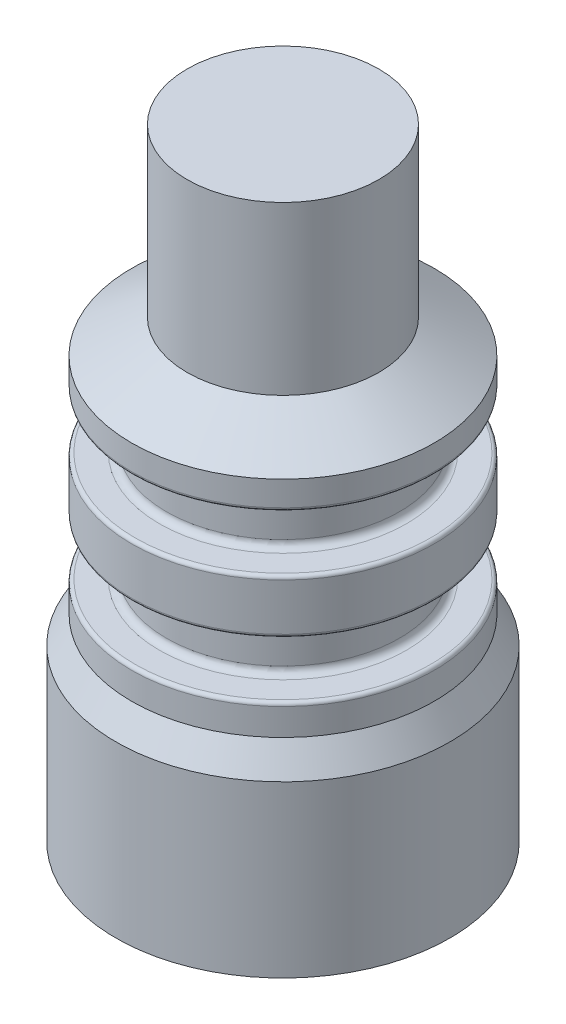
ISO-10303-21;
HEADER;
FILE_DESCRIPTION(('STEP AP214'),'2;1');
FILE_NAME('part.step','',(''),(''),'','','');
FILE_SCHEMA(('AUTOMOTIVE_DESIGN { 1 0 10303 214 1 1 1 1 }'));
ENDSEC;
DATA;
#1=APPLICATION_CONTEXT('core data for automotive mechanical design processes');
#2=APPLICATION_PROTOCOL_DEFINITION('international standard','automotive_design',2000,#1);
#3=PRODUCT_CONTEXT('',#1,'mechanical');
#4=PRODUCT('Part','Part','',(#3));
#5=PRODUCT_RELATED_PRODUCT_CATEGORY('part','',(#4));
#6=PRODUCT_DEFINITION_FORMATION('','',#4);
#7=PRODUCT_DEFINITION_CONTEXT('part definition',#1,'design');
#8=PRODUCT_DEFINITION('design','',#6,#7);
#9=PRODUCT_DEFINITION_SHAPE('','',#8);
#10=(LENGTH_UNIT() NAMED_UNIT(*) SI_UNIT(.MILLI.,.METRE.));
#11=(NAMED_UNIT(*) PLANE_ANGLE_UNIT() SI_UNIT($,.RADIAN.));
#12=(NAMED_UNIT(*) SI_UNIT($,.STERADIAN.) SOLID_ANGLE_UNIT());
#13=UNCERTAINTY_MEASURE_WITH_UNIT(LENGTH_MEASURE(1.E-05),#10,'distance_accuracy_value','');
#14=(GEOMETRIC_REPRESENTATION_CONTEXT(3) GLOBAL_UNCERTAINTY_ASSIGNED_CONTEXT((#13)) GLOBAL_UNIT_ASSIGNED_CONTEXT((#10,
#11,#12)) REPRESENTATION_CONTEXT('',''));
#15=CARTESIAN_POINT('',(0.,0.,0.));
#16=DIRECTION('',(0.,0.,1.));
#17=DIRECTION('',(1.,0.,0.));
#18=AXIS2_PLACEMENT_3D('',#15,#16,#17);
#19=CARTESIAN_POINT('',(0.,22.68633287,0.));
#20=DIRECTION('',(0.,1.,0.));
#21=DIRECTION('',(0.,0.,1.));
#22=AXIS2_PLACEMENT_3D('',#19,#20,#21);
#23=PLANE('',#22);
#24=CARTESIAN_POINT('',(0.,22.68633287,0.));
#25=DIRECTION('',(0.,-1.,0.));
#26=DIRECTION('',(0.,0.,-1.));
#27=AXIS2_PLACEMENT_3D('',#24,#25,#26);
#28=CIRCLE('',#27,3.5);
#29=CARTESIAN_POINT('',(0.,22.68633287,-3.50000000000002));
#30=VERTEX_POINT('',#29);
#31=EDGE_CURVE('E541',#30,#30,#28,.T.);
#32=ORIENTED_EDGE('',*,*,#31,.F.);
#33=EDGE_LOOP('',(#32));
#34=FACE_BOUND('',#33,.T.);
#35=ADVANCED_FACE('F17',(#34),#23,.T.);
#36=CARTESIAN_POINT('',(0.,22.68633287,0.));
#37=DIRECTION('',(0.,-1.,0.));
#38=DIRECTION('',(0.,0.,-1.));
#39=AXIS2_PLACEMENT_3D('',#36,#37,#38);
#40=CYLINDRICAL_SURFACE('',#39,3.5);
#41=ORIENTED_EDGE('',*,*,#31,.T.);
#42=EDGE_LOOP('',(#41));
#43=FACE_BOUND('',#42,.T.);
#44=CARTESIAN_POINT('',(0.,16.5857043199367,0.));
#45=DIRECTION('',(0.,-1.,0.));
#46=DIRECTION('',(0.,0.,-1.));
#47=AXIS2_PLACEMENT_3D('',#44,#45,#46);
#48=CIRCLE('',#47,3.5000000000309);
#49=CARTESIAN_POINT('',(0.,16.5857043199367,-3.50000000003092));
#50=VERTEX_POINT('',#49);
#51=EDGE_CURVE('E543',#50,#50,#48,.T.);
#52=ORIENTED_EDGE('',*,*,#51,.F.);
#53=EDGE_LOOP('',(#52));
#54=FACE_BOUND('',#53,.T.);
#55=ADVANCED_FACE('F579',(#43,#54),#40,.T.);
#56=CARTESIAN_POINT('',(0.,15.3689615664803,0.));
#57=DIRECTION('',(0.,-1.,0.));
#58=DIRECTION('',(0.,0.,-1.));
#59=AXIS2_PLACEMENT_3D('',#56,#57,#58);
#60=CONICAL_SURFACE('',#59,5.52499999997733,1.02974425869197);
#61=ORIENTED_EDGE('',*,*,#51,.T.);
#62=EDGE_LOOP('',(#61));
#63=FACE_BOUND('',#62,.T.);
#64=CARTESIAN_POINT('',(0.,15.3689615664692,0.));
#65=DIRECTION('',(0.,-1.,0.));
#66=DIRECTION('',(0.,0.,-1.));
#67=AXIS2_PLACEMENT_3D('',#64,#65,#66);
#68=CIRCLE('',#67,5.52500000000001);
#69=CARTESIAN_POINT('',(0.,15.3689615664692,-5.52500000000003));
#70=VERTEX_POINT('',#69);
#71=EDGE_CURVE('E554',#70,#70,#68,.T.);
#72=ORIENTED_EDGE('',*,*,#71,.F.);
#73=EDGE_LOOP('',(#72));
#74=FACE_BOUND('',#73,.T.);
#75=ADVANCED_FACE('F573',(#63,#74),#60,.T.);
#76=CARTESIAN_POINT('',(0.,16.58570432,0.));
#77=DIRECTION('',(0.,-1.,0.));
#78=DIRECTION('',(0.,0.,-1.));
#79=AXIS2_PLACEMENT_3D('',#76,#77,#78);
#80=CYLINDRICAL_SURFACE('',#79,5.52500000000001);
#81=ORIENTED_EDGE('',*,*,#71,.T.);
#82=EDGE_LOOP('',(#81));
#83=FACE_BOUND('',#82,.T.);
#84=CARTESIAN_POINT('',(0.,14.46270432,0.));
#85=DIRECTION('',(0.,-1.,0.));
#86=DIRECTION('',(0.,0.,-1.));
#87=AXIS2_PLACEMENT_3D('',#84,#85,#86);
#88=CIRCLE('',#87,5.525);
#89=CARTESIAN_POINT('',(0.,14.46270432,-5.52500000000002));
#90=VERTEX_POINT('',#89);
#91=EDGE_CURVE('E92',#90,#90,#88,.T.);
#92=ORIENTED_EDGE('',*,*,#91,.F.);
#93=EDGE_LOOP('',(#92));
#94=FACE_BOUND('',#93,.T.);
#95=ADVANCED_FACE('F571',(#83,#94),#80,.T.);
#96=CARTESIAN_POINT('',(0.,14.46270432,0.));
#97=DIRECTION('',(0.,-1.,0.));
#98=DIRECTION('',(0.,0.,-1.));
#99=AXIS2_PLACEMENT_3D('',#96,#97,#98);
#100=TOROIDAL_SURFACE('',#99,5.398,0.127);
#101=ORIENTED_EDGE('',*,*,#91,.T.);
#102=EDGE_LOOP('',(#101));
#103=FACE_BOUND('',#102,.T.);
#104=CARTESIAN_POINT('',(0.,14.33570432,0.));
#105=DIRECTION('',(0.,1.,0.));
#106=DIRECTION('',(0.,0.,-1.));
#107=AXIS2_PLACEMENT_3D('',#104,#105,#106);
#108=CIRCLE('',#107,5.398);
#109=CARTESIAN_POINT('',(0.,14.33570432,5.39799999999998));
#110=VERTEX_POINT('',#109);
#111=CARTESIAN_POINT('',(0.,14.33570432,-5.39800000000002));
#112=VERTEX_POINT('',#111);
#113=EDGE_CURVE('E82',#110,#112,#108,.F.);
#114=ORIENTED_EDGE('',*,*,#113,.F.);
#115=CARTESIAN_POINT('',(0.,14.33570432,0.));
#116=DIRECTION('',(0.,1.,0.));
#117=DIRECTION('',(0.,0.,1.));
#118=AXIS2_PLACEMENT_3D('',#115,#116,#117);
#119=CIRCLE('',#118,5.398);
#120=EDGE_CURVE('E80',#112,#110,#119,.F.);
#121=ORIENTED_EDGE('',*,*,#120,.F.);
#122=EDGE_LOOP('',(#114,#121));
#123=FACE_BOUND('',#122,.T.);
#124=ADVANCED_FACE('F84',(#103,#123),#100,.T.);
#125=CARTESIAN_POINT('',(0.,14.33570432,5.52500000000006));
#126=DIRECTION('',(0.,-1.,0.));
#127=DIRECTION('',(0.,0.,-1.));
#128=AXIS2_PLACEMENT_3D('',#125,#126,#127);
#129=PLANE('',#128);
#130=CARTESIAN_POINT('',(0.,14.33570432,0.));
#131=DIRECTION('',(0.,-1.,0.));
#132=DIRECTION('',(0.,0.,1.));
#133=AXIS2_PLACEMENT_3D('',#130,#131,#132);
#134=CIRCLE('',#133,4.509);
#135=CARTESIAN_POINT('',(0.,14.33570432,-4.50900000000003));
#136=VERTEX_POINT('',#135);
#137=CARTESIAN_POINT('',(0.,14.33570432,4.50899999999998));
#138=VERTEX_POINT('',#137);
#139=EDGE_CURVE('E87',#136,#138,#134,.F.);
#140=ORIENTED_EDGE('',*,*,#139,.T.);
#141=CARTESIAN_POINT('',(0.,14.33570432,0.));
#142=DIRECTION('',(0.,-1.,0.));
#143=DIRECTION('',(0.,0.,-1.));
#144=AXIS2_PLACEMENT_3D('',#141,#142,#143);
#145=CIRCLE('',#144,4.509);
#146=EDGE_CURVE('E132',#138,#136,#145,.F.);
#147=ORIENTED_EDGE('',*,*,#146,.T.);
#148=EDGE_LOOP('',(#140,#147));
#149=FACE_BOUND('',#148,.T.);
#150=ORIENTED_EDGE('',*,*,#120,.T.);
#151=ORIENTED_EDGE('',*,*,#113,.T.);
#152=EDGE_LOOP('',(#150,#151));
#153=FACE_BOUND('',#152,.T.);
#154=ADVANCED_FACE('F91',(#149,#153),#129,.T.);
#155=CARTESIAN_POINT('',(0.,14.08170432,0.));
#156=DIRECTION('',(0.,-1.,0.));
#157=DIRECTION('',(0.,0.,-1.));
#158=AXIS2_PLACEMENT_3D('',#155,#156,#157);
#159=TOROIDAL_SURFACE('',#158,4.509,0.254);
#160=CARTESIAN_POINT('',(0.,14.08170432,0.));
#161=DIRECTION('',(0.,-1.,0.));
#162=DIRECTION('',(0.,0.,-1.));
#163=AXIS2_PLACEMENT_3D('',#160,#161,#162);
#164=CIRCLE('',#163,4.255);
#165=CARTESIAN_POINT('',(0.,14.08170432,-4.255));
#166=VERTEX_POINT('',#165);
#167=EDGE_CURVE('E153',#166,#166,#164,.T.);
#168=ORIENTED_EDGE('',*,*,#167,.F.);
#169=EDGE_LOOP('',(#168));
#170=FACE_BOUND('',#169,.T.);
#171=ORIENTED_EDGE('',*,*,#139,.F.);
#172=ORIENTED_EDGE('',*,*,#146,.F.);
#173=EDGE_LOOP('',(#171,#172));
#174=FACE_BOUND('',#173,.T.);
#175=ADVANCED_FACE('F109',(#170,#174),#159,.F.);
#176=CARTESIAN_POINT('',(0.,0.,0.));
#177=DIRECTION('',(0.,-1.,0.));
#178=DIRECTION('',(0.,0.,-1.));
#179=AXIS2_PLACEMENT_3D('',#176,#177,#178);
#180=CYLINDRICAL_SURFACE('',#179,4.255);
#181=CARTESIAN_POINT('',(0.,12.55970432,0.));
#182=DIRECTION('',(0.,1.,0.));
#183=DIRECTION('',(0.,0.,1.));
#184=AXIS2_PLACEMENT_3D('',#181,#182,#183);
#185=CIRCLE('',#184,4.255);
#186=CARTESIAN_POINT('',(0.,12.55970432,4.25499999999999));
#187=VERTEX_POINT('',#186);
#188=EDGE_CURVE('E155',#187,#187,#185,.T.);
#189=ORIENTED_EDGE('',*,*,#188,.T.);
#190=EDGE_LOOP('',(#189));
#191=FACE_BOUND('',#190,.T.);
#192=ORIENTED_EDGE('',*,*,#167,.T.);
#193=EDGE_LOOP('',(#192));
#194=FACE_BOUND('',#193,.T.);
#195=ADVANCED_FACE('F177',(#191,#194),#180,.T.);
#196=CARTESIAN_POINT('',(0.,12.55970432,0.));
#197=DIRECTION('',(0.,1.,0.));
#198=DIRECTION('',(0.,0.,1.));
#199=AXIS2_PLACEMENT_3D('',#196,#197,#198);
#200=TOROIDAL_SURFACE('',#199,4.509,0.254);
#201=ORIENTED_EDGE('',*,*,#188,.F.);
#202=EDGE_LOOP('',(#201));
#203=FACE_BOUND('',#202,.T.);
#204=CARTESIAN_POINT('',(0.,12.30570432,0.));
#205=DIRECTION('',(0.,1.,0.));
#206=DIRECTION('',(0.,0.,-1.));
#207=AXIS2_PLACEMENT_3D('',#204,#205,#206);
#208=CIRCLE('',#207,4.509);
#209=CARTESIAN_POINT('',(0.,12.30570432,4.509));
#210=VERTEX_POINT('',#209);
#211=CARTESIAN_POINT('',(0.,12.30570432,-4.50900000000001));
#212=VERTEX_POINT('',#211);
#213=EDGE_CURVE('E159',#210,#212,#208,.F.);
#214=ORIENTED_EDGE('',*,*,#213,.F.);
#215=CARTESIAN_POINT('',(0.,12.30570432,0.));
#216=DIRECTION('',(0.,1.,0.));
#217=DIRECTION('',(0.,0.,1.));
#218=AXIS2_PLACEMENT_3D('',#215,#216,#217);
#219=CIRCLE('',#218,4.509);
#220=EDGE_CURVE('E242',#212,#210,#219,.F.);
#221=ORIENTED_EDGE('',*,*,#220,.F.);
#222=EDGE_LOOP('',(#214,#221));
#223=FACE_BOUND('',#222,.T.);
#224=ADVANCED_FACE('F167',(#203,#223),#200,.F.);
#225=CARTESIAN_POINT('',(0.,12.30570432,5.52500000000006));
#226=DIRECTION('',(0.,1.,0.));
#227=DIRECTION('',(0.,0.,1.));
#228=AXIS2_PLACEMENT_3D('',#225,#226,#227);
#229=PLANE('',#228);
#230=ORIENTED_EDGE('',*,*,#213,.T.);
#231=ORIENTED_EDGE('',*,*,#220,.T.);
#232=EDGE_LOOP('',(#230,#231));
#233=FACE_BOUND('',#232,.T.);
#234=CARTESIAN_POINT('',(0.,12.30570432,0.));
#235=DIRECTION('',(0.,-1.,0.));
#236=DIRECTION('',(0.,0.,-1.));
#237=AXIS2_PLACEMENT_3D('',#234,#235,#236);
#238=CIRCLE('',#237,5.398);
#239=CARTESIAN_POINT('',(0.,12.30570432,-5.39800000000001));
#240=VERTEX_POINT('',#239);
#241=CARTESIAN_POINT('',(0.,12.30570432,5.398));
#242=VERTEX_POINT('',#241);
#243=EDGE_CURVE('E211',#240,#242,#238,.T.);
#244=ORIENTED_EDGE('',*,*,#243,.F.);
#245=CARTESIAN_POINT('',(0.,12.30570432,0.));
#246=DIRECTION('',(0.,-1.,0.));
#247=DIRECTION('',(0.,0.,1.));
#248=AXIS2_PLACEMENT_3D('',#245,#246,#247);
#249=CIRCLE('',#248,5.398);
#250=EDGE_CURVE('E221',#242,#240,#249,.T.);
#251=ORIENTED_EDGE('',*,*,#250,.F.);
#252=EDGE_LOOP('',(#244,#251));
#253=FACE_BOUND('',#252,.T.);
#254=ADVANCED_FACE('F176',(#233,#253),#229,.T.);
#255=CARTESIAN_POINT('',(0.,12.17870432,0.));
#256=DIRECTION('',(0.,1.,0.));
#257=DIRECTION('',(0.,0.,1.));
#258=AXIS2_PLACEMENT_3D('',#255,#256,#257);
#259=TOROIDAL_SURFACE('',#258,5.398,0.127);
#260=CARTESIAN_POINT('',(0.,12.17870432,0.));
#261=DIRECTION('',(0.,-1.,0.));
#262=DIRECTION('',(0.,0.,-1.));
#263=AXIS2_PLACEMENT_3D('',#260,#261,#262);
#264=CIRCLE('',#263,5.52500000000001);
#265=CARTESIAN_POINT('',(0.,12.17870432,-5.52500000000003));
#266=VERTEX_POINT('',#265);
#267=EDGE_CURVE('E206',#266,#266,#264,.T.);
#268=ORIENTED_EDGE('',*,*,#267,.F.);
#269=EDGE_LOOP('',(#268));
#270=FACE_BOUND('',#269,.T.);
#271=ORIENTED_EDGE('',*,*,#250,.T.);
#272=ORIENTED_EDGE('',*,*,#243,.T.);
#273=EDGE_LOOP('',(#271,#272));
#274=FACE_BOUND('',#273,.T.);
#275=ADVANCED_FACE('F189',(#270,#274),#259,.T.);
#276=CARTESIAN_POINT('',(0.,16.58570432,0.));
#277=DIRECTION('',(0.,-1.,0.));
#278=DIRECTION('',(0.,0.,-1.));
#279=AXIS2_PLACEMENT_3D('',#276,#277,#278);
#280=CYLINDRICAL_SURFACE('',#279,5.52500000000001);
#281=ORIENTED_EDGE('',*,*,#267,.T.);
#282=EDGE_LOOP('',(#281));
#283=FACE_BOUND('',#282,.T.);
#284=CARTESIAN_POINT('',(0.,10.46270432,0.));
#285=DIRECTION('',(0.,-1.,0.));
#286=DIRECTION('',(0.,0.,-1.));
#287=AXIS2_PLACEMENT_3D('',#284,#285,#286);
#288=CIRCLE('',#287,5.525);
#289=CARTESIAN_POINT('',(0.,10.46270432,-5.52500000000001));
#290=VERTEX_POINT('',#289);
#291=EDGE_CURVE('E254',#290,#290,#288,.T.);
#292=ORIENTED_EDGE('',*,*,#291,.F.);
#293=EDGE_LOOP('',(#292));
#294=FACE_BOUND('',#293,.T.);
#295=ADVANCED_FACE('F199',(#283,#294),#280,.T.);
#296=CARTESIAN_POINT('',(0.,10.46270432,0.));
#297=DIRECTION('',(0.,-1.,0.));
#298=DIRECTION('',(0.,0.,-1.));
#299=AXIS2_PLACEMENT_3D('',#296,#297,#298);
#300=TOROIDAL_SURFACE('',#299,5.398,0.127);
#301=ORIENTED_EDGE('',*,*,#291,.T.);
#302=EDGE_LOOP('',(#301));
#303=FACE_BOUND('',#302,.T.);
#304=CARTESIAN_POINT('',(0.,10.33570432,0.));
#305=DIRECTION('',(0.,1.,0.));
#306=DIRECTION('',(0.,0.,-1.));
#307=AXIS2_PLACEMENT_3D('',#304,#305,#306);
#308=CIRCLE('',#307,5.398);
#309=CARTESIAN_POINT('',(0.,10.33570432,5.398));
#310=VERTEX_POINT('',#309);
#311=CARTESIAN_POINT('',(0.,10.33570432,-5.39800000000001));
#312=VERTEX_POINT('',#311);
#313=EDGE_CURVE('E262',#310,#312,#308,.F.);
#314=ORIENTED_EDGE('',*,*,#313,.F.);
#315=CARTESIAN_POINT('',(0.,10.33570432,0.));
#316=DIRECTION('',(0.,1.,0.));
#317=DIRECTION('',(0.,0.,1.));
#318=AXIS2_PLACEMENT_3D('',#315,#316,#317);
#319=CIRCLE('',#318,5.398);
#320=EDGE_CURVE('E258',#312,#310,#319,.F.);
#321=ORIENTED_EDGE('',*,*,#320,.F.);
#322=EDGE_LOOP('',(#314,#321));
#323=FACE_BOUND('',#322,.T.);
#324=ADVANCED_FACE('F268',(#303,#323),#300,.T.);
#325=CARTESIAN_POINT('',(0.,10.33570432,5.52500000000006));
#326=DIRECTION('',(0.,-1.,0.));
#327=DIRECTION('',(0.,0.,-1.));
#328=AXIS2_PLACEMENT_3D('',#325,#326,#327);
#329=PLANE('',#328);
#330=CARTESIAN_POINT('',(0.,10.33570432,0.));
#331=DIRECTION('',(0.,-1.,0.));
#332=DIRECTION('',(0.,0.,1.));
#333=AXIS2_PLACEMENT_3D('',#330,#331,#332);
#334=CIRCLE('',#333,4.509);
#335=CARTESIAN_POINT('',(0.,10.33570432,-4.50900000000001));
#336=VERTEX_POINT('',#335);
#337=CARTESIAN_POINT('',(0.,10.33570432,4.509));
#338=VERTEX_POINT('',#337);
#339=EDGE_CURVE('E330',#336,#338,#334,.F.);
#340=ORIENTED_EDGE('',*,*,#339,.T.);
#341=CARTESIAN_POINT('',(0.,10.33570432,0.));
#342=DIRECTION('',(0.,-1.,0.));
#343=DIRECTION('',(0.,0.,-1.));
#344=AXIS2_PLACEMENT_3D('',#341,#342,#343);
#345=CIRCLE('',#344,4.509);
#346=EDGE_CURVE('E339',#338,#336,#345,.F.);
#347=ORIENTED_EDGE('',*,*,#346,.T.);
#348=EDGE_LOOP('',(#340,#347));
#349=FACE_BOUND('',#348,.T.);
#350=ORIENTED_EDGE('',*,*,#320,.T.);
#351=ORIENTED_EDGE('',*,*,#313,.T.);
#352=EDGE_LOOP('',(#350,#351));
#353=FACE_BOUND('',#352,.T.);
#354=ADVANCED_FACE('F277',(#349,#353),#329,.T.);
#355=CARTESIAN_POINT('',(0.,10.08170432,0.));
#356=DIRECTION('',(0.,-1.,0.));
#357=DIRECTION('',(0.,0.,-1.));
#358=AXIS2_PLACEMENT_3D('',#355,#356,#357);
#359=TOROIDAL_SURFACE('',#358,4.509,0.254);
#360=CARTESIAN_POINT('',(0.,10.08170432,0.));
#361=DIRECTION('',(0.,-1.,0.));
#362=DIRECTION('',(0.,0.,-1.));
#363=AXIS2_PLACEMENT_3D('',#360,#361,#362);
#364=CIRCLE('',#363,4.255);
#365=CARTESIAN_POINT('',(0.,10.08170432,-4.255));
#366=VERTEX_POINT('',#365);
#367=EDGE_CURVE('E305',#366,#366,#364,.T.);
#368=ORIENTED_EDGE('',*,*,#367,.F.);
#369=EDGE_LOOP('',(#368));
#370=FACE_BOUND('',#369,.T.);
#371=ORIENTED_EDGE('',*,*,#339,.F.);
#372=ORIENTED_EDGE('',*,*,#346,.F.);
#373=EDGE_LOOP('',(#371,#372));
#374=FACE_BOUND('',#373,.T.);
#375=ADVANCED_FACE('F288',(#370,#374),#359,.F.);
#376=CARTESIAN_POINT('',(0.,-4.,0.));
#377=DIRECTION('',(0.,-1.,0.));
#378=DIRECTION('',(0.,0.,-1.));
#379=AXIS2_PLACEMENT_3D('',#376,#377,#378);
#380=CYLINDRICAL_SURFACE('',#379,4.255);
#381=CARTESIAN_POINT('',(0.,8.55970432,0.));
#382=DIRECTION('',(0.,1.,0.));
#383=DIRECTION('',(0.,0.,1.));
#384=AXIS2_PLACEMENT_3D('',#381,#382,#383);
#385=CIRCLE('',#384,4.255);
#386=CARTESIAN_POINT('',(0.,8.55970432,4.255));
#387=VERTEX_POINT('',#386);
#388=EDGE_CURVE('E425',#387,#387,#385,.T.);
#389=ORIENTED_EDGE('',*,*,#388,.T.);
#390=EDGE_LOOP('',(#389));
#391=FACE_BOUND('',#390,.T.);
#392=ORIENTED_EDGE('',*,*,#367,.T.);
#393=EDGE_LOOP('',(#392));
#394=FACE_BOUND('',#393,.T.);
#395=ADVANCED_FACE('F298',(#391,#394),#380,.T.);
#396=CARTESIAN_POINT('',(0.,8.55970432,0.));
#397=DIRECTION('',(0.,1.,0.));
#398=DIRECTION('',(0.,0.,1.));
#399=AXIS2_PLACEMENT_3D('',#396,#397,#398);
#400=TOROIDAL_SURFACE('',#399,4.509,0.254);
#401=ORIENTED_EDGE('',*,*,#388,.F.);
#402=EDGE_LOOP('',(#401));
#403=FACE_BOUND('',#402,.T.);
#404=CARTESIAN_POINT('',(0.,8.30570432,0.));
#405=DIRECTION('',(0.,1.,0.));
#406=DIRECTION('',(0.,0.,-1.));
#407=AXIS2_PLACEMENT_3D('',#404,#405,#406);
#408=CIRCLE('',#407,4.509);
#409=CARTESIAN_POINT('',(0.,8.30570432,4.509));
#410=VERTEX_POINT('',#409);
#411=CARTESIAN_POINT('',(0.,8.30570432,-4.509));
#412=VERTEX_POINT('',#411);
#413=EDGE_CURVE('E432',#410,#412,#408,.F.);
#414=ORIENTED_EDGE('',*,*,#413,.F.);
#415=CARTESIAN_POINT('',(0.,8.30570432,0.));
#416=DIRECTION('',(0.,1.,0.));
#417=DIRECTION('',(0.,0.,1.));
#418=AXIS2_PLACEMENT_3D('',#415,#416,#417);
#419=CIRCLE('',#418,4.509);
#420=EDGE_CURVE('E421',#412,#410,#419,.F.);
#421=ORIENTED_EDGE('',*,*,#420,.F.);
#422=EDGE_LOOP('',(#414,#421));
#423=FACE_BOUND('',#422,.T.);
#424=ADVANCED_FACE('F397',(#403,#423),#400,.F.);
#425=CARTESIAN_POINT('',(0.,8.30570432,5.52500000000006));
#426=DIRECTION('',(0.,1.,0.));
#427=DIRECTION('',(0.,0.,1.));
#428=AXIS2_PLACEMENT_3D('',#425,#426,#427);
#429=PLANE('',#428);
#430=ORIENTED_EDGE('',*,*,#413,.T.);
#431=ORIENTED_EDGE('',*,*,#420,.T.);
#432=EDGE_LOOP('',(#430,#431));
#433=FACE_BOUND('',#432,.T.);
#434=CARTESIAN_POINT('',(0.,8.30570432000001,0.));
#435=DIRECTION('',(0.,-1.,0.));
#436=DIRECTION('',(0.,0.,-1.));
#437=AXIS2_PLACEMENT_3D('',#434,#435,#436);
#438=CIRCLE('',#437,5.398);
#439=CARTESIAN_POINT('',(0.,8.30570432,-5.398));
#440=VERTEX_POINT('',#439);
#441=CARTESIAN_POINT('',(0.,8.30570432,5.398));
#442=VERTEX_POINT('',#441);
#443=EDGE_CURVE('E483',#440,#442,#438,.T.);
#444=ORIENTED_EDGE('',*,*,#443,.F.);
#445=CARTESIAN_POINT('',(0.,8.30570432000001,0.));
#446=DIRECTION('',(0.,-1.,0.));
#447=DIRECTION('',(0.,0.,1.));
#448=AXIS2_PLACEMENT_3D('',#445,#446,#447);
#449=CIRCLE('',#448,5.398);
#450=EDGE_CURVE('E494',#442,#440,#449,.T.);
#451=ORIENTED_EDGE('',*,*,#450,.F.);
#452=EDGE_LOOP('',(#444,#451));
#453=FACE_BOUND('',#452,.T.);
#454=ADVANCED_FACE('F407',(#433,#453),#429,.T.);
#455=CARTESIAN_POINT('',(0.,8.17870432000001,0.));
#456=DIRECTION('',(0.,1.,0.));
#457=DIRECTION('',(0.,0.,1.));
#458=AXIS2_PLACEMENT_3D('',#455,#456,#457);
#459=TOROIDAL_SURFACE('',#458,5.398,0.127);
#460=CARTESIAN_POINT('',(0.,8.17870432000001,0.));
#461=DIRECTION('',(0.,-1.,0.));
#462=DIRECTION('',(0.,0.,-1.));
#463=AXIS2_PLACEMENT_3D('',#460,#461,#462);
#464=CIRCLE('',#463,5.52500000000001);
#465=CARTESIAN_POINT('',(0.,8.17870432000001,-5.52500000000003));
#466=VERTEX_POINT('',#465);
#467=EDGE_CURVE('E478',#466,#466,#464,.T.);
#468=ORIENTED_EDGE('',*,*,#467,.F.);
#469=EDGE_LOOP('',(#468));
#470=FACE_BOUND('',#469,.T.);
#471=ORIENTED_EDGE('',*,*,#450,.T.);
#472=ORIENTED_EDGE('',*,*,#443,.T.);
#473=EDGE_LOOP('',(#471,#472));
#474=FACE_BOUND('',#473,.T.);
#475=ADVANCED_FACE('F469',(#470,#474),#459,.T.);
#476=CARTESIAN_POINT('',(0.,11.0000000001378,0.));
#477=DIRECTION('',(0.,-1.,0.));
#478=DIRECTION('',(0.,0.,-1.));
#479=AXIS2_PLACEMENT_3D('',#476,#477,#478);
#480=CONICAL_SURFACE('',#479,2.09999999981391,1.02974425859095);
#481=CARTESIAN_POINT('',(0.,12.2618073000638,5.68364799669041E-11));
#482=VERTEX_POINT('',#481);
#483=VERTEX_LOOP('',#482);
#484=FACE_BOUND('',#483,.T.);
#485=CARTESIAN_POINT('',(0.,11.,0.));
#486=DIRECTION('',(0.,-1.,0.));
#487=DIRECTION('',(0.,0.,-1.));
#488=AXIS2_PLACEMENT_3D('',#485,#486,#487);
#489=CIRCLE('',#488,2.1);
#490=CARTESIAN_POINT('',(0.,11.,-2.1));
#491=VERTEX_POINT('',#490);
#492=EDGE_CURVE('E524',#491,#491,#489,.T.);
#493=ORIENTED_EDGE('',*,*,#492,.T.);
#494=EDGE_LOOP('',(#493));
#495=FACE_BOUND('',#494,.T.);
#496=ADVANCED_FACE('F466',(#484,#495),#480,.F.);
#497=CARTESIAN_POINT('',(0.,16.58570432,0.));
#498=DIRECTION('',(0.,-1.,0.));
#499=DIRECTION('',(0.,0.,-1.));
#500=AXIS2_PLACEMENT_3D('',#497,#498,#499);
#501=CYLINDRICAL_SURFACE('',#500,5.52500000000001);
#502=ORIENTED_EDGE('',*,*,#467,.T.);
#503=EDGE_LOOP('',(#502));
#504=FACE_BOUND('',#503,.T.);
#505=CARTESIAN_POINT('',(0.,7.1999999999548,0.));
#506=DIRECTION('',(0.,-1.,0.));
#507=DIRECTION('',(0.,0.,-1.));
#508=AXIS2_PLACEMENT_3D('',#505,#506,#507);
#509=CIRCLE('',#508,5.5250000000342);
#510=CARTESIAN_POINT('',(0.,7.1999999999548,-5.5250000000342));
#511=VERTEX_POINT('',#510);
#512=EDGE_CURVE('E527',#511,#511,#509,.T.);
#513=ORIENTED_EDGE('',*,*,#512,.F.);
#514=EDGE_LOOP('',(#513));
#515=FACE_BOUND('',#514,.T.);
#516=ADVANCED_FACE('F462',(#504,#515),#501,.T.);
#517=CARTESIAN_POINT('',(0.,0.,0.));
#518=DIRECTION('',(0.,-1.,0.));
#519=DIRECTION('',(0.,0.,-1.));
#520=AXIS2_PLACEMENT_3D('',#517,#518,#519);
#521=CYLINDRICAL_SURFACE('',#520,2.1);
#522=ORIENTED_EDGE('',*,*,#492,.F.);
#523=EDGE_LOOP('',(#522));
#524=FACE_BOUND('',#523,.T.);
#525=CARTESIAN_POINT('',(0.,0.,0.));
#526=DIRECTION('',(0.,-1.,0.));
#527=DIRECTION('',(0.,0.,-1.));
#528=AXIS2_PLACEMENT_3D('',#525,#526,#527);
#529=CIRCLE('',#528,2.1);
#530=CARTESIAN_POINT('',(0.,0.,-2.1));
#531=VERTEX_POINT('',#530);
#532=EDGE_CURVE('E531',#531,#531,#529,.T.);
#533=ORIENTED_EDGE('',*,*,#532,.T.);
#534=EDGE_LOOP('',(#533));
#535=FACE_BOUND('',#534,.T.);
#536=ADVANCED_FACE('F458',(#524,#535),#521,.F.);
#537=CARTESIAN_POINT('',(0.,6.20407078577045,0.));
#538=DIRECTION('',(0.,-1.,0.));
#539=DIRECTION('',(0.,0.,-1.));
#540=AXIS2_PLACEMENT_3D('',#537,#538,#539);
#541=CONICAL_SURFACE('',#540,6.0999999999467,0.523598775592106);
#542=ORIENTED_EDGE('',*,*,#512,.T.);
#543=EDGE_LOOP('',(#542));
#544=FACE_BOUND('',#543,.T.);
#545=CARTESIAN_POINT('',(0.,6.20407078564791,0.));
#546=DIRECTION('',(0.,-1.,0.));
#547=DIRECTION('',(0.,0.,-1.));
#548=AXIS2_PLACEMENT_3D('',#545,#546,#547);
#549=CIRCLE('',#548,6.1);
#550=CARTESIAN_POINT('',(0.,6.20407078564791,-6.1));
#551=VERTEX_POINT('',#550);
#552=EDGE_CURVE('E28',#551,#551,#549,.T.);
#553=ORIENTED_EDGE('',*,*,#552,.F.);
#554=EDGE_LOOP('',(#553));
#555=FACE_BOUND('',#554,.T.);
#556=ADVANCED_FACE('F450',(#544,#555),#541,.T.);
#557=CARTESIAN_POINT('',(0.,0.,0.));
#558=DIRECTION('',(0.,1.,0.));
#559=DIRECTION('',(0.,0.,1.));
#560=AXIS2_PLACEMENT_3D('',#557,#558,#559);
#561=PLANE('',#560);
#562=CARTESIAN_POINT('',(0.,0.,0.));
#563=DIRECTION('',(0.,-1.,0.));
#564=DIRECTION('',(0.,0.,-1.));
#565=AXIS2_PLACEMENT_3D('',#562,#563,#564);
#566=CIRCLE('',#565,6.1);
#567=CARTESIAN_POINT('',(0.,0.,-6.1));
#568=VERTEX_POINT('',#567);
#569=EDGE_CURVE('E11',#568,#568,#566,.F.);
#570=ORIENTED_EDGE('',*,*,#569,.F.);
#571=EDGE_LOOP('',(#570));
#572=FACE_BOUND('',#571,.T.);
#573=ORIENTED_EDGE('',*,*,#532,.F.);
#574=EDGE_LOOP('',(#573));
#575=FACE_BOUND('',#574,.T.);
#576=ADVANCED_FACE('F444',(#572,#575),#561,.F.);
#577=CARTESIAN_POINT('',(0.,7.19999999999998,0.));
#578=DIRECTION('',(0.,-1.,0.));
#579=DIRECTION('',(0.,0.,-1.));
#580=AXIS2_PLACEMENT_3D('',#577,#578,#579);
#581=CYLINDRICAL_SURFACE('',#580,6.1);
#582=ORIENTED_EDGE('',*,*,#552,.T.);
#583=EDGE_LOOP('',(#582));
#584=FACE_BOUND('',#583,.T.);
#585=ORIENTED_EDGE('',*,*,#569,.T.);
#586=EDGE_LOOP('',(#585));
#587=FACE_BOUND('',#586,.T.);
#588=ADVANCED_FACE('F442',(#584,#587),#581,.T.);
#589=CLOSED_SHELL('',(#35,#55,#75,#95,#124,#154,#175,#195,#224,#254,#275,#295,#324,#354,#375,
#395,#424,#454,#475,#496,#516,#536,#556,#576,#588));
#590=MANIFOLD_SOLID_BREP('B1',#589);
#591=ADVANCED_BREP_SHAPE_REPRESENTATION('',(#18,#590),#14);
#592=SHAPE_DEFINITION_REPRESENTATION(#9,#591);
ENDSEC;
END-ISO-10303-21;
